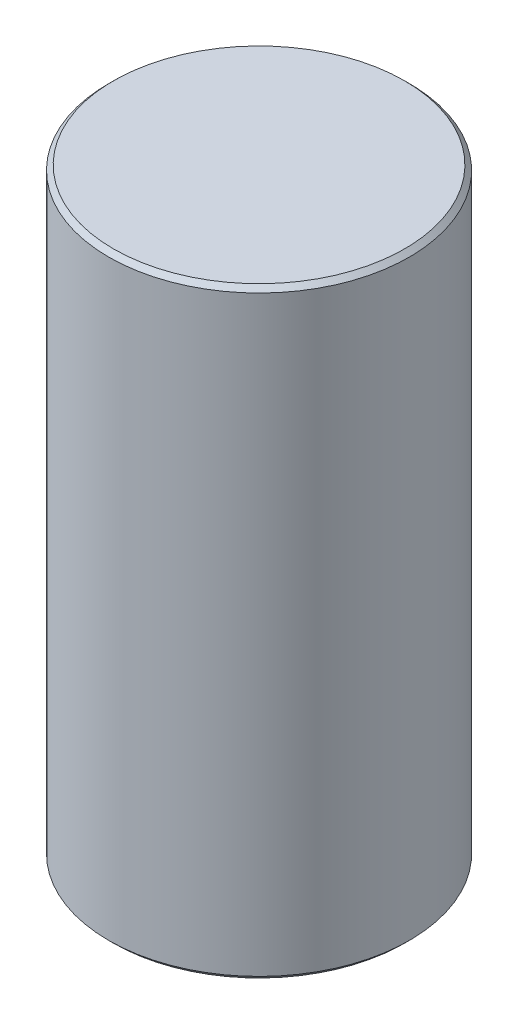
from build123d import *

# Parameters (mm, degrees)
SKETCH1_R      = 3.175
EXTRUDE1_DEPTH = 12.7
CHAMFER1_SIZE  = 0.1


with BuildPart() as part:
    # Sketch1 → Extrude1 (new body)
    with BuildSketch(Plane(origin=(0, 0, 0), x_dir=(1, 0, 0), z_dir=(0, 1, 0))):
        with Locations(Location((0, 0, 0), (0, 0, 270))):
            Circle(SKETCH1_R)
    extrude(amount=-EXTRUDE1_DEPTH)

    # Chamfer1
    chamfer1_edges = [part.edges().sort_by_distance(p)[0] for p in [
        (0, 0, -3.175),
        (0, -12.7, -3.175),
    ]]
    chamfer(chamfer1_edges, length=CHAMFER1_SIZE)


solid = part.part
